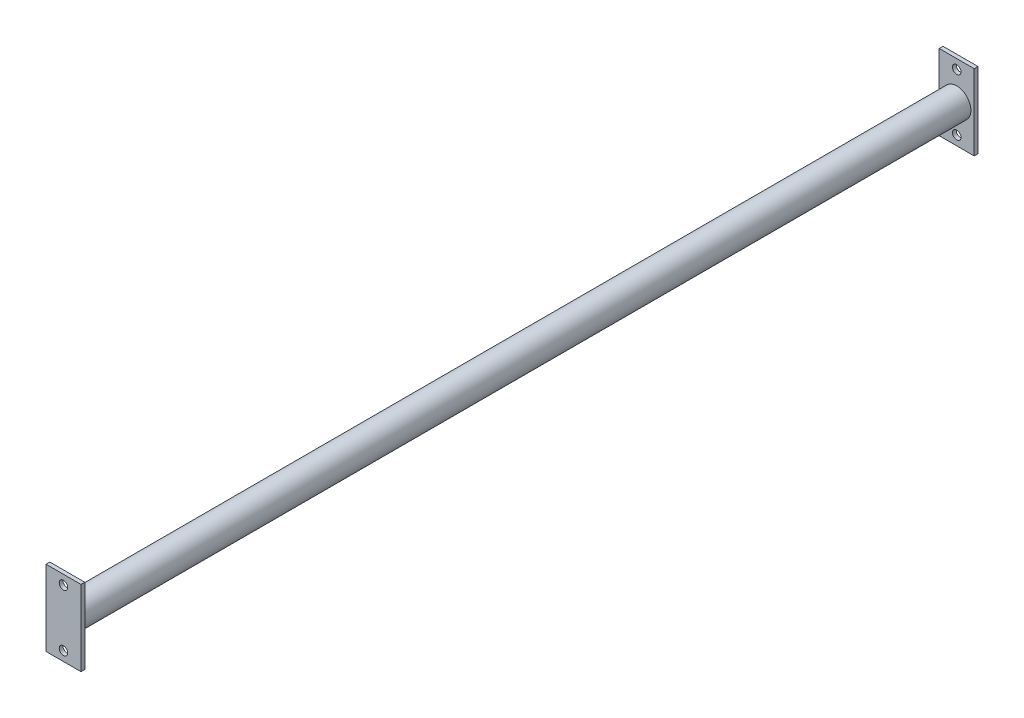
ISO-10303-21;
HEADER;
FILE_DESCRIPTION(('STEP AP214'),'2;1');
FILE_NAME('part.step','',(''),(''),'','','');
FILE_SCHEMA(('AUTOMOTIVE_DESIGN { 1 0 10303 214 1 1 1 1 }'));
ENDSEC;
DATA;
#1=APPLICATION_CONTEXT('core data for automotive mechanical design processes');
#2=APPLICATION_PROTOCOL_DEFINITION('international standard','automotive_design',2000,#1);
#3=PRODUCT_CONTEXT('',#1,'mechanical');
#4=PRODUCT('Part','Part','',(#3));
#5=PRODUCT_RELATED_PRODUCT_CATEGORY('part','',(#4));
#6=PRODUCT_DEFINITION_FORMATION('','',#4);
#7=PRODUCT_DEFINITION_CONTEXT('part definition',#1,'design');
#8=PRODUCT_DEFINITION('design','',#6,#7);
#9=PRODUCT_DEFINITION_SHAPE('','',#8);
#10=(LENGTH_UNIT() NAMED_UNIT(*) SI_UNIT(.MILLI.,.METRE.));
#11=(NAMED_UNIT(*) PLANE_ANGLE_UNIT() SI_UNIT($,.RADIAN.));
#12=(NAMED_UNIT(*) SI_UNIT($,.STERADIAN.) SOLID_ANGLE_UNIT());
#13=UNCERTAINTY_MEASURE_WITH_UNIT(LENGTH_MEASURE(1.E-05),#10,'distance_accuracy_value','');
#14=(GEOMETRIC_REPRESENTATION_CONTEXT(3) GLOBAL_UNCERTAINTY_ASSIGNED_CONTEXT((#13)) GLOBAL_UNIT_ASSIGNED_CONTEXT((#10,
#11,#12)) REPRESENTATION_CONTEXT('',''));
#15=CARTESIAN_POINT('',(0.,0.,0.));
#16=DIRECTION('',(0.,0.,1.));
#17=DIRECTION('',(1.,0.,0.));
#18=AXIS2_PLACEMENT_3D('',#15,#16,#17);
#19=CARTESIAN_POINT('',(0.,0.,470.5));
#20=DIRECTION('',(0.,0.,-1.));
#21=DIRECTION('',(-1.,0.,0.));
#22=AXIS2_PLACEMENT_3D('',#19,#20,#21);
#23=CYLINDRICAL_SURFACE('',#22,15.);
#24=CARTESIAN_POINT('',(0.,0.,470.5));
#25=DIRECTION('',(0.,0.,1.));
#26=DIRECTION('',(1.,0.,0.));
#27=AXIS2_PLACEMENT_3D('',#24,#25,#26);
#28=CIRCLE('',#27,15.);
#29=CARTESIAN_POINT('',(15.,0.,470.5));
#30=VERTEX_POINT('',#29);
#31=EDGE_CURVE('E11',#30,#30,#28,.T.);
#32=ORIENTED_EDGE('',*,*,#31,.F.);
#33=EDGE_LOOP('',(#32));
#34=FACE_BOUND('',#33,.T.);
#35=CARTESIAN_POINT('',(0.,0.,-470.5));
#36=DIRECTION('',(0.,0.,-1.));
#37=DIRECTION('',(-1.,0.,0.));
#38=AXIS2_PLACEMENT_3D('',#35,#36,#37);
#39=CIRCLE('',#38,15.);
#40=CARTESIAN_POINT('',(-15.,0.,-470.5));
#41=VERTEX_POINT('',#40);
#42=EDGE_CURVE('E103',#41,#41,#39,.T.);
#43=ORIENTED_EDGE('',*,*,#42,.F.);
#44=EDGE_LOOP('',(#43));
#45=FACE_BOUND('',#44,.T.);
#46=ADVANCED_FACE('F27',(#34,#45),#23,.T.);
#47=CARTESIAN_POINT('',(-18.5,-40.,470.5));
#48=DIRECTION('',(0.,0.,1.));
#49=DIRECTION('',(1.,0.,0.));
#50=AXIS2_PLACEMENT_3D('',#47,#48,#49);
#51=PLANE('',#50);
#52=CARTESIAN_POINT('',(0.,-30.,470.5));
#53=DIRECTION('',(0.,0.,1.));
#54=DIRECTION('',(1.,0.,0.));
#55=AXIS2_PLACEMENT_3D('',#52,#53,#54);
#56=CIRCLE('',#55,4.5);
#57=CARTESIAN_POINT('',(4.5,-30.,470.5));
#58=VERTEX_POINT('',#57);
#59=EDGE_CURVE('E149',#58,#58,#56,.T.);
#60=ORIENTED_EDGE('',*,*,#59,.T.);
#61=EDGE_LOOP('',(#60));
#62=FACE_BOUND('',#61,.T.);
#63=DIRECTION('',(0.,-1.,0.));
#64=VECTOR('',#63,1.);
#65=CARTESIAN_POINT('',(-18.5,40.,470.5));
#66=LINE('',#65,#64);
#67=CARTESIAN_POINT('',(-18.5,40.,470.5));
#68=VERTEX_POINT('',#67);
#69=CARTESIAN_POINT('',(-18.5,-40.,470.5));
#70=VERTEX_POINT('',#69);
#71=EDGE_CURVE('E155',#68,#70,#66,.T.);
#72=ORIENTED_EDGE('',*,*,#71,.F.);
#73=DIRECTION('',(-1.,0.,0.));
#74=VECTOR('',#73,1.);
#75=CARTESIAN_POINT('',(-18.5,40.,470.5));
#76=LINE('',#75,#74);
#77=CARTESIAN_POINT('',(18.5,40.,470.5));
#78=VERTEX_POINT('',#77);
#79=EDGE_CURVE('E162',#78,#68,#76,.T.);
#80=ORIENTED_EDGE('',*,*,#79,.F.);
#81=DIRECTION('',(0.,1.,0.));
#82=VECTOR('',#81,1.);
#83=CARTESIAN_POINT('',(18.5,40.,470.5));
#84=LINE('',#83,#82);
#85=CARTESIAN_POINT('',(18.5,-40.,470.5));
#86=VERTEX_POINT('',#85);
#87=EDGE_CURVE('E160',#86,#78,#84,.T.);
#88=ORIENTED_EDGE('',*,*,#87,.F.);
#89=DIRECTION('',(1.,0.,0.));
#90=VECTOR('',#89,1.);
#91=CARTESIAN_POINT('',(-18.5,-40.,470.5));
#92=LINE('',#91,#90);
#93=EDGE_CURVE('E158',#70,#86,#92,.T.);
#94=ORIENTED_EDGE('',*,*,#93,.F.);
#95=EDGE_LOOP('',(#72,#80,#88,#94));
#96=FACE_BOUND('',#95,.T.);
#97=CARTESIAN_POINT('',(0.,30.,470.5));
#98=DIRECTION('',(0.,0.,1.));
#99=DIRECTION('',(1.,0.,0.));
#100=AXIS2_PLACEMENT_3D('',#97,#98,#99);
#101=CIRCLE('',#100,4.5);
#102=CARTESIAN_POINT('',(4.5,30.,470.5));
#103=VERTEX_POINT('',#102);
#104=EDGE_CURVE('E143',#103,#103,#101,.T.);
#105=ORIENTED_EDGE('',*,*,#104,.T.);
#106=EDGE_LOOP('',(#105));
#107=FACE_BOUND('',#106,.T.);
#108=ORIENTED_EDGE('',*,*,#31,.T.);
#109=EDGE_LOOP('',(#108));
#110=FACE_BOUND('',#109,.T.);
#111=ADVANCED_FACE('F191',(#62,#96,#107,#110),#51,.F.);
#112=CARTESIAN_POINT('',(-18.5,-40.,474.5));
#113=DIRECTION('',(0.,0.,1.));
#114=DIRECTION('',(1.,0.,0.));
#115=AXIS2_PLACEMENT_3D('',#112,#113,#114);
#116=PLANE('',#115);
#117=CARTESIAN_POINT('',(0.,-30.,474.5));
#118=DIRECTION('',(0.,0.,1.));
#119=DIRECTION('',(1.,0.,0.));
#120=AXIS2_PLACEMENT_3D('',#117,#118,#119);
#121=CIRCLE('',#120,4.5);
#122=CARTESIAN_POINT('',(4.5,-30.,474.5));
#123=VERTEX_POINT('',#122);
#124=EDGE_CURVE('E152',#123,#123,#121,.T.);
#125=ORIENTED_EDGE('',*,*,#124,.F.);
#126=EDGE_LOOP('',(#125));
#127=FACE_BOUND('',#126,.T.);
#128=DIRECTION('',(0.,-1.,0.));
#129=VECTOR('',#128,1.);
#130=CARTESIAN_POINT('',(-18.5,40.,474.5));
#131=LINE('',#130,#129);
#132=CARTESIAN_POINT('',(-18.5,40.,474.5));
#133=VERTEX_POINT('',#132);
#134=CARTESIAN_POINT('',(-18.5,-40.,474.5));
#135=VERTEX_POINT('',#134);
#136=EDGE_CURVE('E164',#133,#135,#131,.T.);
#137=ORIENTED_EDGE('',*,*,#136,.T.);
#138=DIRECTION('',(1.,0.,0.));
#139=VECTOR('',#138,1.);
#140=CARTESIAN_POINT('',(-18.5,-40.,474.5));
#141=LINE('',#140,#139);
#142=CARTESIAN_POINT('',(18.5,-40.,474.5));
#143=VERTEX_POINT('',#142);
#144=EDGE_CURVE('E166',#135,#143,#141,.T.);
#145=ORIENTED_EDGE('',*,*,#144,.T.);
#146=DIRECTION('',(0.,1.,0.));
#147=VECTOR('',#146,1.);
#148=CARTESIAN_POINT('',(18.5,40.,474.5));
#149=LINE('',#148,#147);
#150=CARTESIAN_POINT('',(18.5,40.,474.5));
#151=VERTEX_POINT('',#150);
#152=EDGE_CURVE('E47',#143,#151,#149,.T.);
#153=ORIENTED_EDGE('',*,*,#152,.T.);
#154=DIRECTION('',(-1.,0.,0.));
#155=VECTOR('',#154,1.);
#156=CARTESIAN_POINT('',(-18.5,40.,474.5));
#157=LINE('',#156,#155);
#158=EDGE_CURVE('E42',#151,#133,#157,.T.);
#159=ORIENTED_EDGE('',*,*,#158,.T.);
#160=EDGE_LOOP('',(#137,#145,#153,#159));
#161=FACE_BOUND('',#160,.T.);
#162=CARTESIAN_POINT('',(0.,30.,474.5));
#163=DIRECTION('',(0.,0.,1.));
#164=DIRECTION('',(1.,0.,0.));
#165=AXIS2_PLACEMENT_3D('',#162,#163,#164);
#166=CIRCLE('',#165,4.5);
#167=CARTESIAN_POINT('',(4.5,30.,474.5));
#168=VERTEX_POINT('',#167);
#169=EDGE_CURVE('E146',#168,#168,#166,.T.);
#170=ORIENTED_EDGE('',*,*,#169,.F.);
#171=EDGE_LOOP('',(#170));
#172=FACE_BOUND('',#171,.T.);
#173=ADVANCED_FACE('F202',(#127,#161,#172),#116,.T.);
#174=CARTESIAN_POINT('',(-18.5,40.,474.5));
#175=DIRECTION('',(1.,0.,0.));
#176=DIRECTION('',(0.,1.,0.));
#177=AXIS2_PLACEMENT_3D('',#174,#175,#176);
#178=PLANE('',#177);
#179=ORIENTED_EDGE('',*,*,#71,.T.);
#180=DIRECTION('',(0.,0.,-1.));
#181=VECTOR('',#180,1.);
#182=CARTESIAN_POINT('',(-18.5,-40.,474.5));
#183=LINE('',#182,#181);
#184=EDGE_CURVE('E179',#135,#70,#183,.T.);
#185=ORIENTED_EDGE('',*,*,#184,.F.);
#186=ORIENTED_EDGE('',*,*,#136,.F.);
#187=DIRECTION('',(0.,0.,-1.));
#188=VECTOR('',#187,1.);
#189=CARTESIAN_POINT('',(-18.5,40.,474.5));
#190=LINE('',#189,#188);
#191=EDGE_CURVE('E170',#133,#68,#190,.T.);
#192=ORIENTED_EDGE('',*,*,#191,.T.);
#193=EDGE_LOOP('',(#179,#185,#186,#192));
#194=FACE_BOUND('',#193,.T.);
#195=ADVANCED_FACE('F207',(#194),#178,.F.);
#196=CARTESIAN_POINT('',(-18.5,-40.,474.5));
#197=DIRECTION('',(0.,1.,0.));
#198=DIRECTION('',(0.,0.,1.));
#199=AXIS2_PLACEMENT_3D('',#196,#197,#198);
#200=PLANE('',#199);
#201=ORIENTED_EDGE('',*,*,#93,.T.);
#202=DIRECTION('',(0.,0.,-1.));
#203=VECTOR('',#202,1.);
#204=CARTESIAN_POINT('',(18.5,-40.,474.5));
#205=LINE('',#204,#203);
#206=EDGE_CURVE('E176',#143,#86,#205,.T.);
#207=ORIENTED_EDGE('',*,*,#206,.F.);
#208=ORIENTED_EDGE('',*,*,#144,.F.);
#209=ORIENTED_EDGE('',*,*,#184,.T.);
#210=EDGE_LOOP('',(#201,#207,#208,#209));
#211=FACE_BOUND('',#210,.T.);
#212=ADVANCED_FACE('F270',(#211),#200,.F.);
#213=CARTESIAN_POINT('',(18.5,40.,474.5));
#214=DIRECTION('',(-1.,0.,0.));
#215=DIRECTION('',(0.,-1.,0.));
#216=AXIS2_PLACEMENT_3D('',#213,#214,#215);
#217=PLANE('',#216);
#218=ORIENTED_EDGE('',*,*,#87,.T.);
#219=DIRECTION('',(0.,0.,-1.));
#220=VECTOR('',#219,1.);
#221=CARTESIAN_POINT('',(18.5,40.,474.5));
#222=LINE('',#221,#220);
#223=EDGE_CURVE('E173',#151,#78,#222,.T.);
#224=ORIENTED_EDGE('',*,*,#223,.F.);
#225=ORIENTED_EDGE('',*,*,#152,.F.);
#226=ORIENTED_EDGE('',*,*,#206,.T.);
#227=EDGE_LOOP('',(#218,#224,#225,#226));
#228=FACE_BOUND('',#227,.T.);
#229=ADVANCED_FACE('F257',(#228),#217,.F.);
#230=CARTESIAN_POINT('',(-18.5,40.,474.5));
#231=DIRECTION('',(0.,-1.,0.));
#232=DIRECTION('',(0.,0.,-1.));
#233=AXIS2_PLACEMENT_3D('',#230,#231,#232);
#234=PLANE('',#233);
#235=ORIENTED_EDGE('',*,*,#79,.T.);
#236=ORIENTED_EDGE('',*,*,#191,.F.);
#237=ORIENTED_EDGE('',*,*,#158,.F.);
#238=ORIENTED_EDGE('',*,*,#223,.T.);
#239=EDGE_LOOP('',(#235,#236,#237,#238));
#240=FACE_BOUND('',#239,.T.);
#241=ADVANCED_FACE('F252',(#240),#234,.F.);
#242=CARTESIAN_POINT('',(0.,-30.,474.5));
#243=DIRECTION('',(0.,0.,-1.));
#244=DIRECTION('',(-1.,0.,0.));
#245=AXIS2_PLACEMENT_3D('',#242,#243,#244);
#246=CYLINDRICAL_SURFACE('',#245,4.5);
#247=ORIENTED_EDGE('',*,*,#124,.T.);
#248=EDGE_LOOP('',(#247));
#249=FACE_BOUND('',#248,.T.);
#250=ORIENTED_EDGE('',*,*,#59,.F.);
#251=EDGE_LOOP('',(#250));
#252=FACE_BOUND('',#251,.T.);
#253=ADVANCED_FACE('F229',(#249,#252),#246,.F.);
#254=CARTESIAN_POINT('',(0.,30.,474.5));
#255=DIRECTION('',(0.,0.,-1.));
#256=DIRECTION('',(-1.,0.,0.));
#257=AXIS2_PLACEMENT_3D('',#254,#255,#256);
#258=CYLINDRICAL_SURFACE('',#257,4.5);
#259=ORIENTED_EDGE('',*,*,#169,.T.);
#260=EDGE_LOOP('',(#259));
#261=FACE_BOUND('',#260,.T.);
#262=ORIENTED_EDGE('',*,*,#104,.F.);
#263=EDGE_LOOP('',(#262));
#264=FACE_BOUND('',#263,.T.);
#265=ADVANCED_FACE('F222',(#261,#264),#258,.F.);
#266=CARTESIAN_POINT('',(-18.5,-40.,-470.5));
#267=DIRECTION('',(0.,0.,-1.));
#268=DIRECTION('',(1.,0.,0.));
#269=AXIS2_PLACEMENT_3D('',#266,#267,#268);
#270=PLANE('',#269);
#271=CARTESIAN_POINT('',(0.,30.,-470.5));
#272=DIRECTION('',(0.,0.,1.));
#273=DIRECTION('',(1.,0.,0.));
#274=AXIS2_PLACEMENT_3D('',#271,#272,#273);
#275=CIRCLE('',#274,4.5);
#276=CARTESIAN_POINT('',(4.5,30.,-470.5));
#277=VERTEX_POINT('',#276);
#278=EDGE_CURVE('E361',#277,#277,#275,.T.);
#279=ORIENTED_EDGE('',*,*,#278,.F.);
#280=EDGE_LOOP('',(#279));
#281=FACE_BOUND('',#280,.T.);
#282=CARTESIAN_POINT('',(0.,-30.,-470.5));
#283=DIRECTION('',(0.,0.,1.));
#284=DIRECTION('',(1.,0.,0.));
#285=AXIS2_PLACEMENT_3D('',#282,#283,#284);
#286=CIRCLE('',#285,4.5);
#287=CARTESIAN_POINT('',(4.5,-30.,-470.5));
#288=VERTEX_POINT('',#287);
#289=EDGE_CURVE('E363',#288,#288,#286,.T.);
#290=ORIENTED_EDGE('',*,*,#289,.F.);
#291=EDGE_LOOP('',(#290));
#292=FACE_BOUND('',#291,.T.);
#293=DIRECTION('',(0.,-1.,0.));
#294=VECTOR('',#293,1.);
#295=CARTESIAN_POINT('',(-18.5,40.,-470.5));
#296=LINE('',#295,#294);
#297=CARTESIAN_POINT('',(-18.5,40.,-470.5));
#298=VERTEX_POINT('',#297);
#299=CARTESIAN_POINT('',(-18.5,-40.,-470.5));
#300=VERTEX_POINT('',#299);
#301=EDGE_CURVE('E107',#298,#300,#296,.T.);
#302=ORIENTED_EDGE('',*,*,#301,.T.);
#303=DIRECTION('',(1.,0.,0.));
#304=VECTOR('',#303,1.);
#305=CARTESIAN_POINT('',(-18.5,-40.,-470.5));
#306=LINE('',#305,#304);
#307=CARTESIAN_POINT('',(18.5,-40.,-470.5));
#308=VERTEX_POINT('',#307);
#309=EDGE_CURVE('E120',#300,#308,#306,.T.);
#310=ORIENTED_EDGE('',*,*,#309,.T.);
#311=DIRECTION('',(0.,1.,0.));
#312=VECTOR('',#311,1.);
#313=CARTESIAN_POINT('',(18.5,40.,-470.5));
#314=LINE('',#313,#312);
#315=CARTESIAN_POINT('',(18.5,40.,-470.5));
#316=VERTEX_POINT('',#315);
#317=EDGE_CURVE('E118',#308,#316,#314,.T.);
#318=ORIENTED_EDGE('',*,*,#317,.T.);
#319=DIRECTION('',(-1.,0.,0.));
#320=VECTOR('',#319,1.);
#321=CARTESIAN_POINT('',(-18.5,40.,-470.5));
#322=LINE('',#321,#320);
#323=EDGE_CURVE('E96',#316,#298,#322,.T.);
#324=ORIENTED_EDGE('',*,*,#323,.T.);
#325=EDGE_LOOP('',(#302,#310,#318,#324));
#326=FACE_BOUND('',#325,.T.);
#327=ORIENTED_EDGE('',*,*,#42,.T.);
#328=EDGE_LOOP('',(#327));
#329=FACE_BOUND('',#328,.T.);
#330=ADVANCED_FACE('F115',(#281,#292,#326,#329),#270,.F.);
#331=CARTESIAN_POINT('',(-18.5,40.,-474.5));
#332=DIRECTION('',(-1.,0.,0.));
#333=DIRECTION('',(0.,-1.,0.));
#334=AXIS2_PLACEMENT_3D('',#331,#332,#333);
#335=PLANE('',#334);
#336=ORIENTED_EDGE('',*,*,#301,.F.);
#337=DIRECTION('',(0.,0.,1.));
#338=VECTOR('',#337,1.);
#339=CARTESIAN_POINT('',(-18.5,40.,-474.5));
#340=LINE('',#339,#338);
#341=CARTESIAN_POINT('',(-18.5,40.,-474.5));
#342=VERTEX_POINT('',#341);
#343=EDGE_CURVE('E92',#342,#298,#340,.T.);
#344=ORIENTED_EDGE('',*,*,#343,.F.);
#345=DIRECTION('',(0.,-1.,0.));
#346=VECTOR('',#345,1.);
#347=CARTESIAN_POINT('',(-18.5,40.,-474.5));
#348=LINE('',#347,#346);
#349=CARTESIAN_POINT('',(-18.5,-40.,-474.5));
#350=VERTEX_POINT('',#349);
#351=EDGE_CURVE('E125',#342,#350,#348,.T.);
#352=ORIENTED_EDGE('',*,*,#351,.T.);
#353=DIRECTION('',(0.,0.,1.));
#354=VECTOR('',#353,1.);
#355=CARTESIAN_POINT('',(-18.5,-40.,-474.5));
#356=LINE('',#355,#354);
#357=EDGE_CURVE('E109',#350,#300,#356,.T.);
#358=ORIENTED_EDGE('',*,*,#357,.T.);
#359=EDGE_LOOP('',(#336,#344,#352,#358));
#360=FACE_BOUND('',#359,.T.);
#361=ADVANCED_FACE('F108',(#360),#335,.T.);
#362=CARTESIAN_POINT('',(-18.5,40.,-474.5));
#363=DIRECTION('',(0.,1.,0.));
#364=DIRECTION('',(0.,0.,1.));
#365=AXIS2_PLACEMENT_3D('',#362,#363,#364);
#366=PLANE('',#365);
#367=ORIENTED_EDGE('',*,*,#323,.F.);
#368=DIRECTION('',(0.,0.,1.));
#369=VECTOR('',#368,1.);
#370=CARTESIAN_POINT('',(18.5,40.,-474.5));
#371=LINE('',#370,#369);
#372=CARTESIAN_POINT('',(18.5,40.,-474.5));
#373=VERTEX_POINT('',#372);
#374=EDGE_CURVE('E104',#373,#316,#371,.T.);
#375=ORIENTED_EDGE('',*,*,#374,.F.);
#376=DIRECTION('',(-1.,0.,0.));
#377=VECTOR('',#376,1.);
#378=CARTESIAN_POINT('',(-18.5,40.,-474.5));
#379=LINE('',#378,#377);
#380=EDGE_CURVE('E99',#373,#342,#379,.T.);
#381=ORIENTED_EDGE('',*,*,#380,.T.);
#382=ORIENTED_EDGE('',*,*,#343,.T.);
#383=EDGE_LOOP('',(#367,#375,#381,#382));
#384=FACE_BOUND('',#383,.T.);
#385=ADVANCED_FACE('F94',(#384),#366,.T.);
#386=CARTESIAN_POINT('',(18.5,40.,-474.5));
#387=DIRECTION('',(1.,0.,0.));
#388=DIRECTION('',(0.,1.,0.));
#389=AXIS2_PLACEMENT_3D('',#386,#387,#388);
#390=PLANE('',#389);
#391=ORIENTED_EDGE('',*,*,#317,.F.);
#392=DIRECTION('',(0.,0.,1.));
#393=VECTOR('',#392,1.);
#394=CARTESIAN_POINT('',(18.5,-40.,-474.5));
#395=LINE('',#394,#393);
#396=CARTESIAN_POINT('',(18.5,-40.,-474.5));
#397=VERTEX_POINT('',#396);
#398=EDGE_CURVE('E135',#397,#308,#395,.T.);
#399=ORIENTED_EDGE('',*,*,#398,.F.);
#400=DIRECTION('',(0.,1.,0.));
#401=VECTOR('',#400,1.);
#402=CARTESIAN_POINT('',(18.5,40.,-474.5));
#403=LINE('',#402,#401);
#404=EDGE_CURVE('E128',#397,#373,#403,.T.);
#405=ORIENTED_EDGE('',*,*,#404,.T.);
#406=ORIENTED_EDGE('',*,*,#374,.T.);
#407=EDGE_LOOP('',(#391,#399,#405,#406));
#408=FACE_BOUND('',#407,.T.);
#409=ADVANCED_FACE('F245',(#408),#390,.T.);
#410=CARTESIAN_POINT('',(-18.5,-40.,-474.5));
#411=DIRECTION('',(0.,-1.,0.));
#412=DIRECTION('',(0.,0.,-1.));
#413=AXIS2_PLACEMENT_3D('',#410,#411,#412);
#414=PLANE('',#413);
#415=ORIENTED_EDGE('',*,*,#309,.F.);
#416=ORIENTED_EDGE('',*,*,#357,.F.);
#417=DIRECTION('',(1.,0.,0.));
#418=VECTOR('',#417,1.);
#419=CARTESIAN_POINT('',(-18.5,-40.,-474.5));
#420=LINE('',#419,#418);
#421=EDGE_CURVE('E131',#350,#397,#420,.T.);
#422=ORIENTED_EDGE('',*,*,#421,.T.);
#423=ORIENTED_EDGE('',*,*,#398,.T.);
#424=EDGE_LOOP('',(#415,#416,#422,#423));
#425=FACE_BOUND('',#424,.T.);
#426=ADVANCED_FACE('F241',(#425),#414,.T.);
#427=CARTESIAN_POINT('',(-18.5,-40.,-474.5));
#428=DIRECTION('',(0.,0.,-1.));
#429=DIRECTION('',(1.,0.,0.));
#430=AXIS2_PLACEMENT_3D('',#427,#428,#429);
#431=PLANE('',#430);
#432=CARTESIAN_POINT('',(0.,30.,-474.5));
#433=DIRECTION('',(0.,0.,1.));
#434=DIRECTION('',(1.,0.,0.));
#435=AXIS2_PLACEMENT_3D('',#432,#433,#434);
#436=CIRCLE('',#435,4.5);
#437=CARTESIAN_POINT('',(4.5,30.,-474.5));
#438=VERTEX_POINT('',#437);
#439=EDGE_CURVE('E359',#438,#438,#436,.T.);
#440=ORIENTED_EDGE('',*,*,#439,.T.);
#441=EDGE_LOOP('',(#440));
#442=FACE_BOUND('',#441,.T.);
#443=CARTESIAN_POINT('',(0.,-30.,-474.5));
#444=DIRECTION('',(0.,0.,1.));
#445=DIRECTION('',(1.,0.,0.));
#446=AXIS2_PLACEMENT_3D('',#443,#444,#445);
#447=CIRCLE('',#446,4.5);
#448=CARTESIAN_POINT('',(4.5,-30.,-474.5));
#449=VERTEX_POINT('',#448);
#450=EDGE_CURVE('E113',#449,#449,#447,.T.);
#451=ORIENTED_EDGE('',*,*,#450,.T.);
#452=EDGE_LOOP('',(#451));
#453=FACE_BOUND('',#452,.T.);
#454=ORIENTED_EDGE('',*,*,#351,.F.);
#455=ORIENTED_EDGE('',*,*,#380,.F.);
#456=ORIENTED_EDGE('',*,*,#404,.F.);
#457=ORIENTED_EDGE('',*,*,#421,.F.);
#458=EDGE_LOOP('',(#454,#455,#456,#457));
#459=FACE_BOUND('',#458,.T.);
#460=ADVANCED_FACE('F238',(#442,#453,#459),#431,.T.);
#461=CARTESIAN_POINT('',(0.,-30.,-474.5));
#462=DIRECTION('',(0.,0.,1.));
#463=DIRECTION('',(1.,0.,0.));
#464=AXIS2_PLACEMENT_3D('',#461,#462,#463);
#465=CYLINDRICAL_SURFACE('',#464,4.5);
#466=ORIENTED_EDGE('',*,*,#450,.F.);
#467=EDGE_LOOP('',(#466));
#468=FACE_BOUND('',#467,.T.);
#469=ORIENTED_EDGE('',*,*,#289,.T.);
#470=EDGE_LOOP('',(#469));
#471=FACE_BOUND('',#470,.T.);
#472=ADVANCED_FACE('F236',(#468,#471),#465,.F.);
#473=CARTESIAN_POINT('',(0.,30.,-474.5));
#474=DIRECTION('',(0.,0.,1.));
#475=DIRECTION('',(1.,0.,0.));
#476=AXIS2_PLACEMENT_3D('',#473,#474,#475);
#477=CYLINDRICAL_SURFACE('',#476,4.5);
#478=ORIENTED_EDGE('',*,*,#439,.F.);
#479=EDGE_LOOP('',(#478));
#480=FACE_BOUND('',#479,.T.);
#481=ORIENTED_EDGE('',*,*,#278,.T.);
#482=EDGE_LOOP('',(#481));
#483=FACE_BOUND('',#482,.T.);
#484=ADVANCED_FACE('F344',(#480,#483),#477,.F.);
#485=CLOSED_SHELL('',(#46,#111,#173,#195,#212,#229,#241,#253,#265,#330,#361,#385,#409,#426,#460,
#472,#484));
#486=CARTESIAN_POINT('',(0.,0.,-470.5));
#487=DIRECTION('',(0.,0.,1.));
#488=DIRECTION('',(1.,0.,0.));
#489=AXIS2_PLACEMENT_3D('',#486,#487,#488);
#490=CIRCLE('',#489,14.);
#491=CARTESIAN_POINT('',(14.,0.,-470.5));
#492=VERTEX_POINT('',#491);
#493=EDGE_CURVE('E140',#492,#492,#490,.T.);
#494=ORIENTED_EDGE('',*,*,#493,.T.);
#495=EDGE_LOOP('',(#494));
#496=FACE_BOUND('',#495,.T.);
#497=ADVANCED_FACE('F189',(#496),#270,.F.);
#498=CARTESIAN_POINT('',(0.,0.,470.5));
#499=DIRECTION('',(0.,0.,1.));
#500=DIRECTION('',(1.,0.,0.));
#501=AXIS2_PLACEMENT_3D('',#498,#499,#500);
#502=CIRCLE('',#501,14.);
#503=CARTESIAN_POINT('',(14.,0.,470.5));
#504=VERTEX_POINT('',#503);
#505=EDGE_CURVE('E35',#504,#504,#502,.T.);
#506=ORIENTED_EDGE('',*,*,#505,.F.);
#507=EDGE_LOOP('',(#506));
#508=FACE_BOUND('',#507,.T.);
#509=ADVANCED_FACE('F187',(#508),#51,.F.);
#510=CARTESIAN_POINT('',(0.,0.,470.5));
#511=DIRECTION('',(0.,0.,-1.));
#512=DIRECTION('',(-1.,0.,0.));
#513=AXIS2_PLACEMENT_3D('',#510,#511,#512);
#514=CYLINDRICAL_SURFACE('',#513,14.);
#515=ORIENTED_EDGE('',*,*,#505,.T.);
#516=EDGE_LOOP('',(#515));
#517=FACE_BOUND('',#516,.T.);
#518=ORIENTED_EDGE('',*,*,#493,.F.);
#519=EDGE_LOOP('',(#518));
#520=FACE_BOUND('',#519,.T.);
#521=ADVANCED_FACE('F184',(#517,#520),#514,.F.);
#522=CLOSED_SHELL('',(#497,#509,#521));
#523=ORIENTED_CLOSED_SHELL('',*,#522,.T.);
#524=BREP_WITH_VOIDS('B2',#485,(#523));
#525=ADVANCED_BREP_SHAPE_REPRESENTATION('',(#18,#524),#14);
#526=SHAPE_DEFINITION_REPRESENTATION(#9,#525);
ENDSEC;
END-ISO-10303-21;
